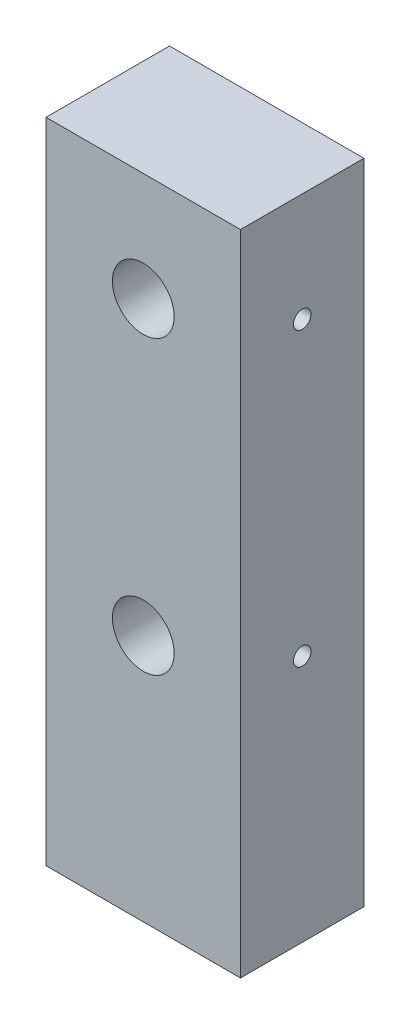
ISO-10303-21;
HEADER;
FILE_DESCRIPTION(('STEP AP214'),'2;1');
FILE_NAME('part.step','',(''),(''),'','','');
FILE_SCHEMA(('AUTOMOTIVE_DESIGN { 1 0 10303 214 1 1 1 1 }'));
ENDSEC;
DATA;
#1=APPLICATION_CONTEXT('core data for automotive mechanical design processes');
#2=APPLICATION_PROTOCOL_DEFINITION('international standard','automotive_design',2000,#1);
#3=PRODUCT_CONTEXT('',#1,'mechanical');
#4=PRODUCT('Part','Part','',(#3));
#5=PRODUCT_RELATED_PRODUCT_CATEGORY('part','',(#4));
#6=PRODUCT_DEFINITION_FORMATION('','',#4);
#7=PRODUCT_DEFINITION_CONTEXT('part definition',#1,'design');
#8=PRODUCT_DEFINITION('design','',#6,#7);
#9=PRODUCT_DEFINITION_SHAPE('','',#8);
#10=(LENGTH_UNIT() NAMED_UNIT(*) SI_UNIT(.MILLI.,.METRE.));
#11=(NAMED_UNIT(*) PLANE_ANGLE_UNIT() SI_UNIT($,.RADIAN.));
#12=(NAMED_UNIT(*) SI_UNIT($,.STERADIAN.) SOLID_ANGLE_UNIT());
#13=UNCERTAINTY_MEASURE_WITH_UNIT(LENGTH_MEASURE(1.E-05),#10,'distance_accuracy_value','');
#14=(GEOMETRIC_REPRESENTATION_CONTEXT(3) GLOBAL_UNCERTAINTY_ASSIGNED_CONTEXT((#13)) GLOBAL_UNIT_ASSIGNED_CONTEXT((#10,
#11,#12)) REPRESENTATION_CONTEXT('',''));
#15=CARTESIAN_POINT('',(0.,0.,0.));
#16=DIRECTION('',(0.,0.,1.));
#17=DIRECTION('',(1.,0.,0.));
#18=AXIS2_PLACEMENT_3D('',#15,#16,#17);
#19=CARTESIAN_POINT('',(15.,100.,-9.525));
#20=DIRECTION('',(-1.,0.,0.));
#21=DIRECTION('',(0.,0.,1.));
#22=AXIS2_PLACEMENT_3D('',#19,#20,#21);
#23=PLANE('',#22);
#24=CARTESIAN_POINT('',(15.,38.25,0.));
#25=DIRECTION('',(1.,0.,0.));
#26=DIRECTION('',(0.,0.,-1.));
#27=AXIS2_PLACEMENT_3D('',#24,#25,#26);
#28=CIRCLE('',#27,1.35254999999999);
#29=CARTESIAN_POINT('',(15.,38.25,-1.35254999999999));
#30=VERTEX_POINT('',#29);
#31=EDGE_CURVE('E163',#30,#30,#28,.T.);
#32=ORIENTED_EDGE('',*,*,#31,.F.);
#33=EDGE_LOOP('',(#32));
#34=FACE_BOUND('',#33,.T.);
#35=CARTESIAN_POINT('',(15.,83.25,0.));
#36=DIRECTION('',(1.,0.,0.));
#37=DIRECTION('',(0.,0.,-1.));
#38=AXIS2_PLACEMENT_3D('',#35,#36,#37);
#39=CIRCLE('',#38,1.35254999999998);
#40=CARTESIAN_POINT('',(15.,83.25,-1.35254999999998));
#41=VERTEX_POINT('',#40);
#42=EDGE_CURVE('E166',#41,#41,#39,.T.);
#43=ORIENTED_EDGE('',*,*,#42,.F.);
#44=EDGE_LOOP('',(#43));
#45=FACE_BOUND('',#44,.T.);
#46=DIRECTION('',(0.,0.,-1.));
#47=VECTOR('',#46,1.);
#48=CARTESIAN_POINT('',(15.,0.,-9.525));
#49=LINE('',#48,#47);
#50=CARTESIAN_POINT('',(15.,0.,9.525));
#51=VERTEX_POINT('',#50);
#52=CARTESIAN_POINT('',(15.,0.,-9.525));
#53=VERTEX_POINT('',#52);
#54=EDGE_CURVE('E115',#51,#53,#49,.T.);
#55=ORIENTED_EDGE('',*,*,#54,.T.);
#56=DIRECTION('',(0.,-1.,0.));
#57=VECTOR('',#56,1.);
#58=CARTESIAN_POINT('',(15.,100.,-9.525));
#59=LINE('',#58,#57);
#60=CARTESIAN_POINT('',(15.,100.,-9.525));
#61=VERTEX_POINT('',#60);
#62=EDGE_CURVE('E11',#61,#53,#59,.T.);
#63=ORIENTED_EDGE('',*,*,#62,.F.);
#64=DIRECTION('',(0.,0.,-1.));
#65=VECTOR('',#64,1.);
#66=CARTESIAN_POINT('',(15.,100.,-9.525));
#67=LINE('',#66,#65);
#68=CARTESIAN_POINT('',(15.,100.,9.525));
#69=VERTEX_POINT('',#68);
#70=EDGE_CURVE('E116',#69,#61,#67,.T.);
#71=ORIENTED_EDGE('',*,*,#70,.F.);
#72=DIRECTION('',(0.,-1.,0.));
#73=VECTOR('',#72,1.);
#74=CARTESIAN_POINT('',(15.,100.,9.525));
#75=LINE('',#74,#73);
#76=EDGE_CURVE('E122',#69,#51,#75,.T.);
#77=ORIENTED_EDGE('',*,*,#76,.T.);
#78=EDGE_LOOP('',(#55,#63,#71,#77));
#79=FACE_BOUND('',#78,.T.);
#80=ADVANCED_FACE('F38',(#34,#45,#79),#23,.F.);
#81=CARTESIAN_POINT('',(-15.,100.,-9.525));
#82=DIRECTION('',(0.,0.,1.));
#83=DIRECTION('',(1.,0.,0.));
#84=AXIS2_PLACEMENT_3D('',#81,#82,#83);
#85=PLANE('',#84);
#86=CARTESIAN_POINT('',(0.,83.25,-9.525));
#87=DIRECTION('',(0.,0.,-1.));
#88=DIRECTION('',(-1.,0.,0.));
#89=AXIS2_PLACEMENT_3D('',#86,#87,#88);
#90=CIRCLE('',#89,4.7625);
#91=CARTESIAN_POINT('',(-4.7625,83.25,-9.525));
#92=VERTEX_POINT('',#91);
#93=EDGE_CURVE('E172',#92,#92,#90,.T.);
#94=ORIENTED_EDGE('',*,*,#93,.F.);
#95=EDGE_LOOP('',(#94));
#96=FACE_BOUND('',#95,.T.);
#97=CARTESIAN_POINT('',(0.,38.25,-9.525));
#98=DIRECTION('',(0.,0.,-1.));
#99=DIRECTION('',(-1.,0.,0.));
#100=AXIS2_PLACEMENT_3D('',#97,#98,#99);
#101=CIRCLE('',#100,4.7625);
#102=CARTESIAN_POINT('',(-4.7625,38.25,-9.525));
#103=VERTEX_POINT('',#102);
#104=EDGE_CURVE('E214',#103,#103,#101,.T.);
#105=ORIENTED_EDGE('',*,*,#104,.F.);
#106=EDGE_LOOP('',(#105));
#107=FACE_BOUND('',#106,.T.);
#108=DIRECTION('',(-1.,0.,0.));
#109=VECTOR('',#108,1.);
#110=CARTESIAN_POINT('',(-15.,0.,-9.525));
#111=LINE('',#110,#109);
#112=CARTESIAN_POINT('',(-15.,0.,-9.525));
#113=VERTEX_POINT('',#112);
#114=EDGE_CURVE('E125',#53,#113,#111,.T.);
#115=ORIENTED_EDGE('',*,*,#114,.T.);
#116=DIRECTION('',(0.,-1.,0.));
#117=VECTOR('',#116,1.);
#118=CARTESIAN_POINT('',(-15.,100.,-9.525));
#119=LINE('',#118,#117);
#120=CARTESIAN_POINT('',(-15.,100.,-9.525));
#121=VERTEX_POINT('',#120);
#122=EDGE_CURVE('E46',#121,#113,#119,.T.);
#123=ORIENTED_EDGE('',*,*,#122,.F.);
#124=DIRECTION('',(-1.,0.,0.));
#125=VECTOR('',#124,1.);
#126=CARTESIAN_POINT('',(-15.,100.,-9.525));
#127=LINE('',#126,#125);
#128=EDGE_CURVE('E85',#61,#121,#127,.T.);
#129=ORIENTED_EDGE('',*,*,#128,.F.);
#130=ORIENTED_EDGE('',*,*,#62,.T.);
#131=EDGE_LOOP('',(#115,#123,#129,#130));
#132=FACE_BOUND('',#131,.T.);
#133=ADVANCED_FACE('F149',(#96,#107,#132),#85,.F.);
#134=CARTESIAN_POINT('',(-15.,100.,-9.525));
#135=DIRECTION('',(1.,0.,0.));
#136=DIRECTION('',(0.,0.,-1.));
#137=AXIS2_PLACEMENT_3D('',#134,#135,#136);
#138=PLANE('',#137);
#139=DIRECTION('',(0.,0.,1.));
#140=VECTOR('',#139,1.);
#141=CARTESIAN_POINT('',(-15.,0.,-9.525));
#142=LINE('',#141,#140);
#143=CARTESIAN_POINT('',(-15.,0.,9.525));
#144=VERTEX_POINT('',#143);
#145=EDGE_CURVE('E72',#113,#144,#142,.T.);
#146=ORIENTED_EDGE('',*,*,#145,.T.);
#147=DIRECTION('',(0.,-1.,0.));
#148=VECTOR('',#147,1.);
#149=CARTESIAN_POINT('',(-15.,100.,9.525));
#150=LINE('',#149,#148);
#151=CARTESIAN_POINT('',(-15.,100.,9.525));
#152=VERTEX_POINT('',#151);
#153=EDGE_CURVE('E130',#152,#144,#150,.T.);
#154=ORIENTED_EDGE('',*,*,#153,.F.);
#155=DIRECTION('',(0.,0.,1.));
#156=VECTOR('',#155,1.);
#157=CARTESIAN_POINT('',(-15.,100.,-9.525));
#158=LINE('',#157,#156);
#159=EDGE_CURVE('E119',#121,#152,#158,.T.);
#160=ORIENTED_EDGE('',*,*,#159,.F.);
#161=ORIENTED_EDGE('',*,*,#122,.T.);
#162=EDGE_LOOP('',(#146,#154,#160,#161));
#163=FACE_BOUND('',#162,.T.);
#164=ADVANCED_FACE('F132',(#163),#138,.F.);
#165=CARTESIAN_POINT('',(-15.,100.,9.525));
#166=DIRECTION('',(0.,0.,-1.));
#167=DIRECTION('',(-1.,0.,0.));
#168=AXIS2_PLACEMENT_3D('',#165,#166,#167);
#169=PLANE('',#168);
#170=CARTESIAN_POINT('',(0.,83.25,9.525));
#171=DIRECTION('',(0.,0.,-1.));
#172=DIRECTION('',(-1.,0.,0.));
#173=AXIS2_PLACEMENT_3D('',#170,#171,#172);
#174=CIRCLE('',#173,4.7625);
#175=CARTESIAN_POINT('',(-4.7625,83.25,9.525));
#176=VERTEX_POINT('',#175);
#177=EDGE_CURVE('E186',#176,#176,#174,.T.);
#178=ORIENTED_EDGE('',*,*,#177,.T.);
#179=EDGE_LOOP('',(#178));
#180=FACE_BOUND('',#179,.T.);
#181=CARTESIAN_POINT('',(0.,38.25,9.525));
#182=DIRECTION('',(0.,0.,-1.));
#183=DIRECTION('',(-1.,0.,0.));
#184=AXIS2_PLACEMENT_3D('',#181,#182,#183);
#185=CIRCLE('',#184,4.7625);
#186=CARTESIAN_POINT('',(-4.7625,38.25,9.525));
#187=VERTEX_POINT('',#186);
#188=EDGE_CURVE('E109',#187,#187,#185,.T.);
#189=ORIENTED_EDGE('',*,*,#188,.T.);
#190=EDGE_LOOP('',(#189));
#191=FACE_BOUND('',#190,.T.);
#192=DIRECTION('',(1.,0.,0.));
#193=VECTOR('',#192,1.);
#194=CARTESIAN_POINT('',(-15.,0.,9.525));
#195=LINE('',#194,#193);
#196=EDGE_CURVE('E78',#144,#51,#195,.T.);
#197=ORIENTED_EDGE('',*,*,#196,.T.);
#198=ORIENTED_EDGE('',*,*,#76,.F.);
#199=DIRECTION('',(1.,0.,0.));
#200=VECTOR('',#199,1.);
#201=CARTESIAN_POINT('',(-15.,100.,9.525));
#202=LINE('',#201,#200);
#203=EDGE_CURVE('E54',#152,#69,#202,.T.);
#204=ORIENTED_EDGE('',*,*,#203,.F.);
#205=ORIENTED_EDGE('',*,*,#153,.T.);
#206=EDGE_LOOP('',(#197,#198,#204,#205));
#207=FACE_BOUND('',#206,.T.);
#208=ADVANCED_FACE('F139',(#180,#191,#207),#169,.F.);
#209=CARTESIAN_POINT('',(15.,100.,9.525));
#210=DIRECTION('',(0.,1.,0.));
#211=DIRECTION('',(0.,0.,1.));
#212=AXIS2_PLACEMENT_3D('',#209,#210,#211);
#213=PLANE('',#212);
#214=ORIENTED_EDGE('',*,*,#70,.T.);
#215=ORIENTED_EDGE('',*,*,#128,.T.);
#216=ORIENTED_EDGE('',*,*,#159,.T.);
#217=ORIENTED_EDGE('',*,*,#203,.T.);
#218=EDGE_LOOP('',(#214,#215,#216,#217));
#219=FACE_BOUND('',#218,.T.);
#220=ADVANCED_FACE('F141',(#219),#213,.T.);
#221=CARTESIAN_POINT('',(15.,0.,9.525));
#222=DIRECTION('',(0.,1.,0.));
#223=DIRECTION('',(0.,0.,1.));
#224=AXIS2_PLACEMENT_3D('',#221,#222,#223);
#225=PLANE('',#224);
#226=CARTESIAN_POINT('',(-10.,0.,0.));
#227=DIRECTION('',(0.,-1.,0.));
#228=DIRECTION('',(0.,0.,-1.));
#229=AXIS2_PLACEMENT_3D('',#226,#227,#228);
#230=CIRCLE('',#229,2.1);
#231=CARTESIAN_POINT('',(-10.,0.,-2.1));
#232=VERTEX_POINT('',#231);
#233=EDGE_CURVE('E103',#232,#232,#230,.T.);
#234=ORIENTED_EDGE('',*,*,#233,.F.);
#235=EDGE_LOOP('',(#234));
#236=FACE_BOUND('',#235,.T.);
#237=CARTESIAN_POINT('',(10.,0.,0.));
#238=DIRECTION('',(0.,-1.,0.));
#239=DIRECTION('',(0.,0.,-1.));
#240=AXIS2_PLACEMENT_3D('',#237,#238,#239);
#241=CIRCLE('',#240,2.1);
#242=CARTESIAN_POINT('',(10.,0.,-2.1));
#243=VERTEX_POINT('',#242);
#244=EDGE_CURVE('E102',#243,#243,#241,.T.);
#245=ORIENTED_EDGE('',*,*,#244,.F.);
#246=EDGE_LOOP('',(#245));
#247=FACE_BOUND('',#246,.T.);
#248=ORIENTED_EDGE('',*,*,#54,.F.);
#249=ORIENTED_EDGE('',*,*,#196,.F.);
#250=ORIENTED_EDGE('',*,*,#145,.F.);
#251=ORIENTED_EDGE('',*,*,#114,.F.);
#252=EDGE_LOOP('',(#248,#249,#250,#251));
#253=FACE_BOUND('',#252,.T.);
#254=ADVANCED_FACE('F135',(#236,#247,#253),#225,.F.);
#255=CARTESIAN_POINT('',(10.,12.4,0.));
#256=DIRECTION('',(0.,-1.,0.));
#257=DIRECTION('',(0.,0.,-1.));
#258=AXIS2_PLACEMENT_3D('',#255,#256,#257);
#259=CONICAL_SURFACE('',#258,2.1,1.02974425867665);
#260=CARTESIAN_POINT('',(10.,13.6618072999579,0.));
#261=VERTEX_POINT('',#260);
#262=VERTEX_LOOP('',#261);
#263=FACE_BOUND('',#262,.T.);
#264=CARTESIAN_POINT('',(10.,12.4,0.));
#265=DIRECTION('',(0.,-1.,0.));
#266=DIRECTION('',(0.,0.,-1.));
#267=AXIS2_PLACEMENT_3D('',#264,#265,#266);
#268=CIRCLE('',#267,2.1);
#269=CARTESIAN_POINT('',(10.,12.4,-2.1));
#270=VERTEX_POINT('',#269);
#271=EDGE_CURVE('E106',#270,#270,#268,.T.);
#272=ORIENTED_EDGE('',*,*,#271,.T.);
#273=EDGE_LOOP('',(#272));
#274=FACE_BOUND('',#273,.T.);
#275=ADVANCED_FACE('F230',(#263,#274),#259,.F.);
#276=CARTESIAN_POINT('',(10.,0.,0.));
#277=DIRECTION('',(0.,-1.,0.));
#278=DIRECTION('',(0.,0.,-1.));
#279=AXIS2_PLACEMENT_3D('',#276,#277,#278);
#280=CYLINDRICAL_SURFACE('',#279,2.1);
#281=ORIENTED_EDGE('',*,*,#271,.F.);
#282=EDGE_LOOP('',(#281));
#283=FACE_BOUND('',#282,.T.);
#284=ORIENTED_EDGE('',*,*,#244,.T.);
#285=EDGE_LOOP('',(#284));
#286=FACE_BOUND('',#285,.T.);
#287=ADVANCED_FACE('F96',(#283,#286),#280,.F.);
#288=CARTESIAN_POINT('',(-10.,12.4,0.));
#289=DIRECTION('',(0.,-1.,0.));
#290=DIRECTION('',(0.,0.,-1.));
#291=AXIS2_PLACEMENT_3D('',#288,#289,#290);
#292=CONICAL_SURFACE('',#291,2.1,1.02974425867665);
#293=CARTESIAN_POINT('',(-10.,13.6618072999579,0.));
#294=VERTEX_POINT('',#293);
#295=VERTEX_LOOP('',#294);
#296=FACE_BOUND('',#295,.T.);
#297=CARTESIAN_POINT('',(-10.,12.4,0.));
#298=DIRECTION('',(0.,-1.,0.));
#299=DIRECTION('',(0.,0.,-1.));
#300=AXIS2_PLACEMENT_3D('',#297,#298,#299);
#301=CIRCLE('',#300,2.1);
#302=CARTESIAN_POINT('',(-10.,12.4,-2.1));
#303=VERTEX_POINT('',#302);
#304=EDGE_CURVE('E100',#303,#303,#301,.T.);
#305=ORIENTED_EDGE('',*,*,#304,.T.);
#306=EDGE_LOOP('',(#305));
#307=FACE_BOUND('',#306,.T.);
#308=ADVANCED_FACE('F92',(#296,#307),#292,.F.);
#309=CARTESIAN_POINT('',(-10.,0.,0.));
#310=DIRECTION('',(0.,-1.,0.));
#311=DIRECTION('',(0.,0.,-1.));
#312=AXIS2_PLACEMENT_3D('',#309,#310,#311);
#313=CYLINDRICAL_SURFACE('',#312,2.1);
#314=ORIENTED_EDGE('',*,*,#304,.F.);
#315=EDGE_LOOP('',(#314));
#316=FACE_BOUND('',#315,.T.);
#317=ORIENTED_EDGE('',*,*,#233,.T.);
#318=EDGE_LOOP('',(#317));
#319=FACE_BOUND('',#318,.T.);
#320=ADVANCED_FACE('F95',(#316,#319),#313,.F.);
#321=CARTESIAN_POINT('',(0.,38.25,9.525));
#322=DIRECTION('',(0.,0.,-1.));
#323=DIRECTION('',(-1.,0.,0.));
#324=AXIS2_PLACEMENT_3D('',#321,#322,#323);
#325=CYLINDRICAL_SURFACE('',#324,4.7625);
#326=CARTESIAN_POINT('',(4.7625,38.25,-1.35254999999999));
#327=CARTESIAN_POINT('',(4.7624990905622,38.3243784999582,-1.3525486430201));
#328=CARTESIAN_POINT('',(4.76074068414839,38.3987709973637,-1.34639427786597));
#329=CARTESIAN_POINT('',(4.75389731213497,38.5454010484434,-1.3219904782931));
#330=CARTESIAN_POINT('',(4.74881105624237,38.6176377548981,-1.30373635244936));
#331=CARTESIAN_POINT('',(4.73587132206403,38.7578193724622,-1.25578329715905));
#332=CARTESIAN_POINT('',(4.72802167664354,38.8257700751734,-1.22610021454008));
#333=CARTESIAN_POINT('',(4.710377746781,38.9557295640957,-1.15619378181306));
#334=CARTESIAN_POINT('',(4.7005832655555,39.0177377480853,-1.11596936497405));
#335=CARTESIAN_POINT('',(4.67981587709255,39.135664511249,-1.02501870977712));
#336=CARTESIAN_POINT('',(4.66882075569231,39.1914066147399,-0.974068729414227));
#337=CARTESIAN_POINT('',(4.64702871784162,39.2936811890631,-0.863590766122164));
#338=CARTESIAN_POINT('',(4.63623183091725,39.3402122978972,-0.804061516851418));
#339=CARTESIAN_POINT('',(4.61582763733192,39.4236387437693,-0.676663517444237));
#340=CARTESIAN_POINT('',(4.60624815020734,39.4603248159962,-0.608652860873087));
#341=CARTESIAN_POINT('',(4.5896927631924,39.5216694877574,-0.467112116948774));
#342=CARTESIAN_POINT('',(4.58271631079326,39.54633063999,-0.393583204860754));
#343=CARTESIAN_POINT('',(4.57238733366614,39.5823006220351,-0.245061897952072));
#344=CARTESIAN_POINT('',(4.56894739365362,39.5939322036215,-0.170153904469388));
#345=CARTESIAN_POINT('',(4.56582030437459,39.6045199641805,-0.0193768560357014));
#346=CARTESIAN_POINT('',(4.5661323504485,39.6034788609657,0.0564919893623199));
#347=CARTESIAN_POINT('',(4.57039612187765,39.5890056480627,0.204465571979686));
#348=CARTESIAN_POINT('',(4.5742311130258,39.575970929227,0.276613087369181));
#349=CARTESIAN_POINT('',(4.58492077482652,39.5385197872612,0.417652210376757));
#350=CARTESIAN_POINT('',(4.59177571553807,39.5141023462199,0.486543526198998));
#351=CARTESIAN_POINT('',(4.60783068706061,39.4542710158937,0.620118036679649));
#352=CARTESIAN_POINT('',(4.61705903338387,39.4187231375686,0.684737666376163));
#353=CARTESIAN_POINT('',(4.63680661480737,39.3377332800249,0.807230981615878));
#354=CARTESIAN_POINT('',(4.64732613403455,39.2922891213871,0.865103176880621));
#355=CARTESIAN_POINT('',(4.66895040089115,39.1907942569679,0.974721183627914));
#356=CARTESIAN_POINT('',(4.68006235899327,39.1344117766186,1.0261588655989));
#357=CARTESIAN_POINT('',(4.701270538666,39.0136835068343,1.11891641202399));
#358=CARTESIAN_POINT('',(4.71136670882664,38.9493373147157,1.16023576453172));
#359=CARTESIAN_POINT('',(4.72948235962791,38.8139892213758,1.23174505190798));
#360=CARTESIAN_POINT('',(4.73749017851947,38.7429528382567,1.26187287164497));
#361=CARTESIAN_POINT('',(4.75044281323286,38.5965425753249,1.30966625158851));
#362=CARTESIAN_POINT('',(4.75538839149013,38.5211697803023,1.32733491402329));
#363=CARTESIAN_POINT('',(4.76154131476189,38.3708506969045,1.34920990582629));
#364=CARTESIAN_POINT('',(4.76286475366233,38.2959699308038,1.35383446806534));
#365=CARTESIAN_POINT('',(4.76196150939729,38.1465004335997,1.35065371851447));
#366=CARTESIAN_POINT('',(4.75973524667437,38.0719116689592,1.3428498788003));
#367=CARTESIAN_POINT('',(4.75205828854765,37.9266796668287,1.31537461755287));
#368=CARTESIAN_POINT('',(4.74667254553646,37.8559874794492,1.29594210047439));
#369=CARTESIAN_POINT('',(4.73329318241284,37.7188775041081,1.24604358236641));
#370=CARTESIAN_POINT('',(4.72529926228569,37.6524602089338,1.21557631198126));
#371=CARTESIAN_POINT('',(4.70732543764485,37.5242037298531,1.14373505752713));
#372=CARTESIAN_POINT('',(4.69730658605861,37.4624934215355,1.10214099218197));
#373=CARTESIAN_POINT('',(4.67643766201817,37.3467837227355,1.00949871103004));
#374=CARTESIAN_POINT('',(4.66558740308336,37.2927860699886,0.958448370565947));
#375=CARTESIAN_POINT('',(4.64384180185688,37.1922310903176,0.846382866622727));
#376=CARTESIAN_POINT('',(4.6329563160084,37.1459702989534,0.785099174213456));
#377=CARTESIAN_POINT('',(4.61275127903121,37.0643755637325,0.655404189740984));
#378=CARTESIAN_POINT('',(4.60343167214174,37.0290412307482,0.586993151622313));
#379=CARTESIAN_POINT('',(4.58752245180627,36.970561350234,0.445275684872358));
#380=CARTESIAN_POINT('',(4.58091824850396,36.9473504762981,0.37199794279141));
#381=CARTESIAN_POINT('',(4.5712025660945,36.9136516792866,0.222355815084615));
#382=CARTESIAN_POINT('',(4.5680900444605,36.9031599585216,0.145992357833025));
#383=CARTESIAN_POINT('',(4.56580529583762,36.8954365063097,-0.00459566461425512));
#384=CARTESIAN_POINT('',(4.56649045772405,36.8977248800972,-0.0787937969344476));
#385=CARTESIAN_POINT('',(4.57138541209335,36.9143670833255,-0.22569987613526));
#386=CARTESIAN_POINT('',(4.57559508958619,36.9287205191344,-0.298407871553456));
#387=CARTESIAN_POINT('',(4.58697424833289,36.9687906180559,-0.439574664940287));
#388=CARTESIAN_POINT('',(4.5941138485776,36.9943927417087,-0.508068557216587));
#389=CARTESIAN_POINT('',(4.61054579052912,37.0561448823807,-0.63984262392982));
#390=CARTESIAN_POINT('',(4.61983850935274,37.092296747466,-0.703121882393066));
#391=CARTESIAN_POINT('',(4.63991281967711,37.1755222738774,-0.824929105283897));
#392=CARTESIAN_POINT('',(4.65073344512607,37.2229171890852,-0.883231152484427));
#393=CARTESIAN_POINT('',(4.67244141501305,37.3266891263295,-0.991210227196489));
#394=CARTESIAN_POINT('',(4.68332877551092,37.3830683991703,-1.04088508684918));
#395=CARTESIAN_POINT('',(4.70427270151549,37.504924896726,-1.13144175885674));
#396=CARTESIAN_POINT('',(4.71430135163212,37.5705958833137,-1.17206990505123));
#397=CARTESIAN_POINT('',(4.73207848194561,37.7081207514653,-1.24164775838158));
#398=CARTESIAN_POINT('',(4.73982822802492,37.7799711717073,-1.27060395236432));
#399=CARTESIAN_POINT('',(4.751335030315,37.9178175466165,-1.31282989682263));
#400=CARTESIAN_POINT('',(4.75548935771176,37.9832979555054,-1.32768750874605));
#401=CARTESIAN_POINT('',(4.76107207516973,38.1158485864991,-1.34754753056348));
#402=CARTESIAN_POINT('',(4.76250082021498,38.1829186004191,-1.35255122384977));
#403=CARTESIAN_POINT('',(4.7625,38.25,-1.35254999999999));
#404=B_SPLINE_CURVE_WITH_KNOTS('',3,(#326,#327,#328,#329,#330,#331,#332,#333,#334,#335,#336,
#337,#338,#339,#340,#341,#342,#343,#344,#345,#346,#347,#348,#349,#350,#351,#352,#353,#354,#355,
#356,#357,#358,#359,#360,#361,#362,#363,#364,#365,#366,#367,#368,#369,#370,#371,#372,#373,#374,
#375,#376,#377,#378,#379,#380,#381,#382,#383,#384,#385,#386,#387,#388,#389,#390,#391,#392,#393,
#394,#395,#396,#397,#398,#399,#400,#401,#402,#403),.UNSPECIFIED.,.T.,.F.,(4,2,2,2,2,2,2,2,2,2,2,
2,2,2,2,2,2,2,2,2,2,2,2,2,2,2,2,2,2,2,2,2,2,2,2,2,2,2,4),(0.,0.222889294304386,
0.445865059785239,0.668532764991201,0.891223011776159,1.11912484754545,1.34706035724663,
1.57951364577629,1.81191756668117,2.03842777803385,2.2648894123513,2.48410768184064,
2.70334555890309,2.92533126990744,3.14736591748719,3.37766327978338,3.60797229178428,
3.83954111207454,4.07105225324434,4.29505113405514,4.51902348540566,4.73854523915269,
4.95809225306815,5.18235198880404,5.40666217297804,5.63821506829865,5.86975971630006,
6.10004348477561,6.33025847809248,6.55188840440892,6.77351110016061,6.99292761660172,
7.2123825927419,7.43908482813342,7.6658439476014,7.89832815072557,8.13068296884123,
8.33173130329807,8.53275345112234),.UNSPECIFIED.);
#405=CARTESIAN_POINT('',(4.7625,38.25,-1.35254999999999));
#406=VERTEX_POINT('',#405);
#407=EDGE_CURVE('E169',#406,#406,#404,.T.);
#408=ORIENTED_EDGE('',*,*,#407,.T.);
#409=EDGE_LOOP('',(#408));
#410=FACE_BOUND('',#409,.T.);
#411=ORIENTED_EDGE('',*,*,#188,.F.);
#412=EDGE_LOOP('',(#411));
#413=FACE_BOUND('',#412,.T.);
#414=ORIENTED_EDGE('',*,*,#104,.T.);
#415=EDGE_LOOP('',(#414));
#416=FACE_BOUND('',#415,.T.);
#417=ADVANCED_FACE('F205',(#410,#413,#416),#325,.F.);
#418=CARTESIAN_POINT('',(0.,83.25,9.525));
#419=DIRECTION('',(0.,0.,-1.));
#420=DIRECTION('',(-1.,0.,0.));
#421=AXIS2_PLACEMENT_3D('',#418,#419,#420);
#422=CYLINDRICAL_SURFACE('',#421,4.7625);
#423=CARTESIAN_POINT('',(4.76249999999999,83.25,-1.35254999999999));
#424=CARTESIAN_POINT('',(4.7624990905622,83.3243784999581,-1.35254864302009));
#425=CARTESIAN_POINT('',(4.76074068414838,83.3987709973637,-1.34639427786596));
#426=CARTESIAN_POINT('',(4.75389731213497,83.5454010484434,-1.3219904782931));
#427=CARTESIAN_POINT('',(4.74881105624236,83.6176377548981,-1.30373635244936));
#428=CARTESIAN_POINT('',(4.73587132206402,83.7578193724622,-1.25578329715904));
#429=CARTESIAN_POINT('',(4.72802167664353,83.8257700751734,-1.22610021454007));
#430=CARTESIAN_POINT('',(4.710377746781,83.9557295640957,-1.15619378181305));
#431=CARTESIAN_POINT('',(4.70058326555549,84.0177377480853,-1.11596936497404));
#432=CARTESIAN_POINT('',(4.67981587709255,84.135664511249,-1.02501870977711));
#433=CARTESIAN_POINT('',(4.66882075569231,84.1914066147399,-0.974068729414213));
#434=CARTESIAN_POINT('',(4.64702871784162,84.2936811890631,-0.863590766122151));
#435=CARTESIAN_POINT('',(4.63623183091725,84.3402122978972,-0.804061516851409));
#436=CARTESIAN_POINT('',(4.61582763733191,84.4236387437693,-0.676663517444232));
#437=CARTESIAN_POINT('',(4.60624815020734,84.4603248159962,-0.608652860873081));
#438=CARTESIAN_POINT('',(4.58969276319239,84.5216694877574,-0.467112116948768));
#439=CARTESIAN_POINT('',(4.58271631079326,84.54633063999,-0.393583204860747));
#440=CARTESIAN_POINT('',(4.57238733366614,84.5823006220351,-0.245061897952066));
#441=CARTESIAN_POINT('',(4.56894739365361,84.5939322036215,-0.170153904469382));
#442=CARTESIAN_POINT('',(4.56582030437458,84.6045199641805,-0.019376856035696));
#443=CARTESIAN_POINT('',(4.5661323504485,84.6034788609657,0.056491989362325));
#444=CARTESIAN_POINT('',(4.57039612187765,84.5890056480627,0.204465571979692));
#445=CARTESIAN_POINT('',(4.57423111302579,84.5759709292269,0.276613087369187));
#446=CARTESIAN_POINT('',(4.58492077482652,84.5385197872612,0.417652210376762));
#447=CARTESIAN_POINT('',(4.59177571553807,84.5141023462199,0.486543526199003));
#448=CARTESIAN_POINT('',(4.60783068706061,84.4542710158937,0.620118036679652));
#449=CARTESIAN_POINT('',(4.61705903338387,84.4187231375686,0.684737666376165));
#450=CARTESIAN_POINT('',(4.63680661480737,84.3377332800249,0.80723098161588));
#451=CARTESIAN_POINT('',(4.64732613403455,84.2922891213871,0.865103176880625));
#452=CARTESIAN_POINT('',(4.66895040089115,84.1907942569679,0.974721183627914));
#453=CARTESIAN_POINT('',(4.68006235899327,84.1344117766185,1.0261588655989));
#454=CARTESIAN_POINT('',(4.70127053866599,84.0136835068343,1.11891641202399));
#455=CARTESIAN_POINT('',(4.71136670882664,83.9493373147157,1.16023576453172));
#456=CARTESIAN_POINT('',(4.7294823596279,83.8139892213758,1.23174505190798));
#457=CARTESIAN_POINT('',(4.73749017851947,83.7429528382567,1.26187287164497));
#458=CARTESIAN_POINT('',(4.75044281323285,83.5965425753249,1.30966625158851));
#459=CARTESIAN_POINT('',(4.75538839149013,83.5211697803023,1.32733491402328));
#460=CARTESIAN_POINT('',(4.76154131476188,83.3708506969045,1.34920990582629));
#461=CARTESIAN_POINT('',(4.76286475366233,83.2959699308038,1.35383446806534));
#462=CARTESIAN_POINT('',(4.76196150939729,83.1465004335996,1.35065371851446));
#463=CARTESIAN_POINT('',(4.75973524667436,83.0719116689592,1.34284987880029));
#464=CARTESIAN_POINT('',(4.75205828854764,82.9266796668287,1.31537461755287));
#465=CARTESIAN_POINT('',(4.74667254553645,82.8559874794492,1.29594210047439));
#466=CARTESIAN_POINT('',(4.73329318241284,82.7188775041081,1.24604358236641));
#467=CARTESIAN_POINT('',(4.72529926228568,82.6524602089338,1.21557631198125));
#468=CARTESIAN_POINT('',(4.70732543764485,82.5242037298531,1.14373505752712));
#469=CARTESIAN_POINT('',(4.6973065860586,82.4624934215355,1.10214099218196));
#470=CARTESIAN_POINT('',(4.67643766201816,82.3467837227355,1.00949871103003));
#471=CARTESIAN_POINT('',(4.66558740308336,82.2927860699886,0.958448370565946));
#472=CARTESIAN_POINT('',(4.64384180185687,82.1922310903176,0.846382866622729));
#473=CARTESIAN_POINT('',(4.6329563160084,82.1459702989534,0.785099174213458));
#474=CARTESIAN_POINT('',(4.61275127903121,82.0643755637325,0.655404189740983));
#475=CARTESIAN_POINT('',(4.60343167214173,82.0290412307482,0.58699315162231));
#476=CARTESIAN_POINT('',(4.58752245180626,81.970561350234,0.445275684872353));
#477=CARTESIAN_POINT('',(4.58091824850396,81.9473504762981,0.371997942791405));
#478=CARTESIAN_POINT('',(4.5712025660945,81.9136516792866,0.22235581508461));
#479=CARTESIAN_POINT('',(4.5680900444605,81.9031599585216,0.14599235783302));
#480=CARTESIAN_POINT('',(4.56580529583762,81.8954365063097,-0.00459566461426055));
#481=CARTESIAN_POINT('',(4.56649045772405,81.8977248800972,-0.0787937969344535));
#482=CARTESIAN_POINT('',(4.57138541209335,81.9143670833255,-0.225699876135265));
#483=CARTESIAN_POINT('',(4.57559508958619,81.9287205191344,-0.29840787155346));
#484=CARTESIAN_POINT('',(4.58697424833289,81.9687906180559,-0.439574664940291));
#485=CARTESIAN_POINT('',(4.5941138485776,81.9943927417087,-0.508068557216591));
#486=CARTESIAN_POINT('',(4.61054579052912,82.0561448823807,-0.639842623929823));
#487=CARTESIAN_POINT('',(4.61983850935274,82.092296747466,-0.703121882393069));
#488=CARTESIAN_POINT('',(4.6399128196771,82.1755222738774,-0.824929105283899));
#489=CARTESIAN_POINT('',(4.65073344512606,82.2229171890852,-0.883231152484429));
#490=CARTESIAN_POINT('',(4.67244141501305,82.3266891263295,-0.991210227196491));
#491=CARTESIAN_POINT('',(4.68332877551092,82.3830683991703,-1.04088508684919));
#492=CARTESIAN_POINT('',(4.70427270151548,82.504924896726,-1.13144175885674));
#493=CARTESIAN_POINT('',(4.71430135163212,82.5705958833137,-1.17206990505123));
#494=CARTESIAN_POINT('',(4.73207848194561,82.7081207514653,-1.24164775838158));
#495=CARTESIAN_POINT('',(4.73982822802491,82.7799711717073,-1.27060395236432));
#496=CARTESIAN_POINT('',(4.751335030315,82.9178175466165,-1.31282989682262));
#497=CARTESIAN_POINT('',(4.75548935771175,82.9832979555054,-1.32768750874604));
#498=CARTESIAN_POINT('',(4.76107207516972,83.1158485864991,-1.34754753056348));
#499=CARTESIAN_POINT('',(4.76250082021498,83.1829186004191,-1.35255122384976));
#500=CARTESIAN_POINT('',(4.76249999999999,83.25,-1.35254999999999));
#501=B_SPLINE_CURVE_WITH_KNOTS('',3,(#423,#424,#425,#426,#427,#428,#429,#430,#431,#432,#433,
#434,#435,#436,#437,#438,#439,#440,#441,#442,#443,#444,#445,#446,#447,#448,#449,#450,#451,#452,
#453,#454,#455,#456,#457,#458,#459,#460,#461,#462,#463,#464,#465,#466,#467,#468,#469,#470,#471,
#472,#473,#474,#475,#476,#477,#478,#479,#480,#481,#482,#483,#484,#485,#486,#487,#488,#489,#490,
#491,#492,#493,#494,#495,#496,#497,#498,#499,#500),.UNSPECIFIED.,.T.,.F.,(4,2,2,2,2,2,2,2,2,2,2,
2,2,2,2,2,2,2,2,2,2,2,2,2,2,2,2,2,2,2,2,2,2,2,2,2,2,2,4),(0.,0.222889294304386,
0.445865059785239,0.668532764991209,0.891223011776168,1.11912484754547,1.34706035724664,
1.57951364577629,1.81191756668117,2.03842777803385,2.2648894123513,2.48410768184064,
2.70334555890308,2.92533126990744,3.14736591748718,3.37766327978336,3.60797229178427,
3.83954111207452,4.07105225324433,4.29505113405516,4.51902348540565,4.7385452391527,
4.95809225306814,5.18235198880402,5.40666217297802,5.63821506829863,5.86975971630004,
6.10004348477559,6.33025847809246,6.55188840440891,6.77351110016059,6.9929276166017,
7.21238259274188,7.4390848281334,7.66584394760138,7.89832815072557,8.13068296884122,
8.33173130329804,8.53275345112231),.UNSPECIFIED.);
#502=CARTESIAN_POINT('',(4.76249999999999,83.25,-1.35254999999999));
#503=VERTEX_POINT('',#502);
#504=EDGE_CURVE('E168',#503,#503,#501,.T.);
#505=ORIENTED_EDGE('',*,*,#504,.T.);
#506=EDGE_LOOP('',(#505));
#507=FACE_BOUND('',#506,.T.);
#508=ORIENTED_EDGE('',*,*,#177,.F.);
#509=EDGE_LOOP('',(#508));
#510=FACE_BOUND('',#509,.T.);
#511=ORIENTED_EDGE('',*,*,#93,.T.);
#512=EDGE_LOOP('',(#511));
#513=FACE_BOUND('',#512,.T.);
#514=ADVANCED_FACE('F194',(#507,#510,#513),#422,.F.);
#515=CARTESIAN_POINT('',(15.,83.25,0.));
#516=DIRECTION('',(1.,0.,0.));
#517=DIRECTION('',(0.,0.,-1.));
#518=AXIS2_PLACEMENT_3D('',#515,#516,#517);
#519=CYLINDRICAL_SURFACE('',#518,1.35254999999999);
#520=ORIENTED_EDGE('',*,*,#504,.F.);
#521=EDGE_LOOP('',(#520));
#522=FACE_BOUND('',#521,.T.);
#523=ORIENTED_EDGE('',*,*,#42,.T.);
#524=EDGE_LOOP('',(#523));
#525=FACE_BOUND('',#524,.T.);
#526=ADVANCED_FACE('F190',(#522,#525),#519,.F.);
#527=CARTESIAN_POINT('',(15.,38.25,0.));
#528=DIRECTION('',(1.,0.,0.));
#529=DIRECTION('',(0.,0.,-1.));
#530=AXIS2_PLACEMENT_3D('',#527,#528,#529);
#531=CYLINDRICAL_SURFACE('',#530,1.35254999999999);
#532=ORIENTED_EDGE('',*,*,#407,.F.);
#533=EDGE_LOOP('',(#532));
#534=FACE_BOUND('',#533,.T.);
#535=ORIENTED_EDGE('',*,*,#31,.T.);
#536=EDGE_LOOP('',(#535));
#537=FACE_BOUND('',#536,.T.);
#538=ADVANCED_FACE('F193',(#534,#537),#531,.F.);
#539=CLOSED_SHELL('',(#80,#133,#164,#208,#220,#254,#275,#287,#308,#320,#417,#514,#526,#538));
#540=MANIFOLD_SOLID_BREP('B2',#539);
#541=ADVANCED_BREP_SHAPE_REPRESENTATION('',(#18,#540),#14);
#542=SHAPE_DEFINITION_REPRESENTATION(#9,#541);
ENDSEC;
END-ISO-10303-21;
